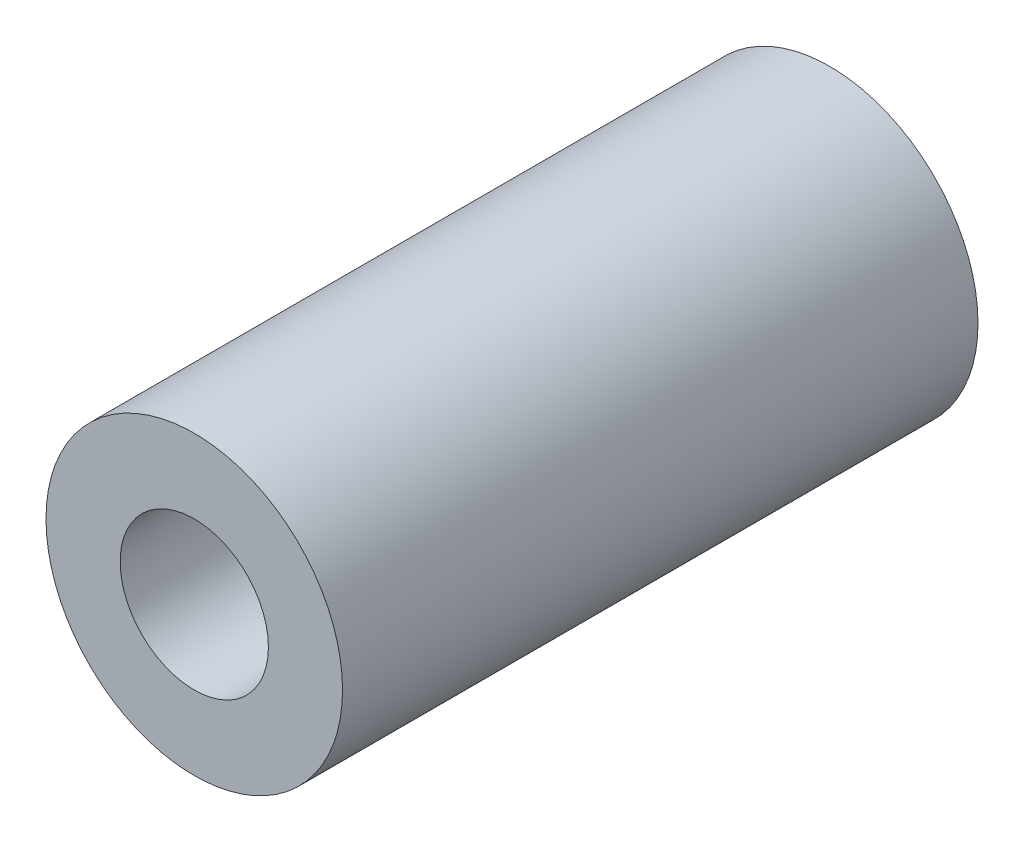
ISO-10303-21;
HEADER;
FILE_DESCRIPTION(('STEP AP214'),'2;1');
FILE_NAME('part.step','',(''),(''),'','','');
FILE_SCHEMA(('AUTOMOTIVE_DESIGN { 1 0 10303 214 1 1 1 1 }'));
ENDSEC;
DATA;
#1=APPLICATION_CONTEXT('core data for automotive mechanical design processes');
#2=APPLICATION_PROTOCOL_DEFINITION('international standard','automotive_design',2000,#1);
#3=PRODUCT_CONTEXT('',#1,'mechanical');
#4=PRODUCT('Part','Part','',(#3));
#5=PRODUCT_RELATED_PRODUCT_CATEGORY('part','',(#4));
#6=PRODUCT_DEFINITION_FORMATION('','',#4);
#7=PRODUCT_DEFINITION_CONTEXT('part definition',#1,'design');
#8=PRODUCT_DEFINITION('design','',#6,#7);
#9=PRODUCT_DEFINITION_SHAPE('','',#8);
#10=(LENGTH_UNIT() NAMED_UNIT(*) SI_UNIT(.MILLI.,.METRE.));
#11=(NAMED_UNIT(*) PLANE_ANGLE_UNIT() SI_UNIT($,.RADIAN.));
#12=(NAMED_UNIT(*) SI_UNIT($,.STERADIAN.) SOLID_ANGLE_UNIT());
#13=UNCERTAINTY_MEASURE_WITH_UNIT(LENGTH_MEASURE(1.E-05),#10,'distance_accuracy_value','');
#14=(GEOMETRIC_REPRESENTATION_CONTEXT(3) GLOBAL_UNCERTAINTY_ASSIGNED_CONTEXT((#13)) GLOBAL_UNIT_ASSIGNED_CONTEXT((#10,
#11,#12)) REPRESENTATION_CONTEXT('',''));
#15=CARTESIAN_POINT('',(0.,0.,0.));
#16=DIRECTION('',(0.,0.,1.));
#17=DIRECTION('',(1.,0.,0.));
#18=AXIS2_PLACEMENT_3D('',#15,#16,#17);
#19=CARTESIAN_POINT('',(0.,0.,-15.));
#20=DIRECTION('',(0.,0.,1.));
#21=DIRECTION('',(1.,0.,0.));
#22=AXIS2_PLACEMENT_3D('',#19,#20,#21);
#23=CYLINDRICAL_SURFACE('',#22,3.5);
#24=CARTESIAN_POINT('',(0.,0.,-15.));
#25=DIRECTION('',(0.,0.,1.));
#26=DIRECTION('',(1.,0.,0.));
#27=AXIS2_PLACEMENT_3D('',#24,#25,#26);
#28=CIRCLE('',#27,3.5);
#29=CARTESIAN_POINT('',(3.5,0.,-15.));
#30=VERTEX_POINT('',#29);
#31=EDGE_CURVE('E10',#30,#30,#28,.T.);
#32=ORIENTED_EDGE('',*,*,#31,.T.);
#33=EDGE_LOOP('',(#32));
#34=FACE_BOUND('',#33,.T.);
#35=CARTESIAN_POINT('',(0.,0.,0.));
#36=DIRECTION('',(0.,0.,1.));
#37=DIRECTION('',(1.,0.,0.));
#38=AXIS2_PLACEMENT_3D('',#35,#36,#37);
#39=CIRCLE('',#38,3.5);
#40=CARTESIAN_POINT('',(3.5,0.,0.));
#41=VERTEX_POINT('',#40);
#42=EDGE_CURVE('E30',#41,#41,#39,.T.);
#43=ORIENTED_EDGE('',*,*,#42,.F.);
#44=EDGE_LOOP('',(#43));
#45=FACE_BOUND('',#44,.T.);
#46=ADVANCED_FACE('F24',(#34,#45),#23,.T.);
#47=CARTESIAN_POINT('',(0.,0.,-15.));
#48=DIRECTION('',(0.,0.,1.));
#49=DIRECTION('',(1.,0.,0.));
#50=AXIS2_PLACEMENT_3D('',#47,#48,#49);
#51=PLANE('',#50);
#52=CARTESIAN_POINT('',(0.,0.,-15.));
#53=DIRECTION('',(0.,0.,1.));
#54=DIRECTION('',(1.,0.,0.));
#55=AXIS2_PLACEMENT_3D('',#52,#53,#54);
#56=CIRCLE('',#55,1.75);
#57=CARTESIAN_POINT('',(1.75,0.,-15.));
#58=VERTEX_POINT('',#57);
#59=EDGE_CURVE('E34',#58,#58,#56,.T.);
#60=ORIENTED_EDGE('',*,*,#59,.T.);
#61=EDGE_LOOP('',(#60));
#62=FACE_BOUND('',#61,.T.);
#63=ORIENTED_EDGE('',*,*,#31,.F.);
#64=EDGE_LOOP('',(#63));
#65=FACE_BOUND('',#64,.T.);
#66=ADVANCED_FACE('F48',(#62,#65),#51,.F.);
#67=CARTESIAN_POINT('',(0.,0.,0.));
#68=DIRECTION('',(0.,0.,1.));
#69=DIRECTION('',(1.,0.,0.));
#70=AXIS2_PLACEMENT_3D('',#67,#68,#69);
#71=PLANE('',#70);
#72=CARTESIAN_POINT('',(0.,0.,0.));
#73=DIRECTION('',(0.,0.,1.));
#74=DIRECTION('',(1.,0.,0.));
#75=AXIS2_PLACEMENT_3D('',#72,#73,#74);
#76=CIRCLE('',#75,1.75);
#77=CARTESIAN_POINT('',(1.75,0.,0.));
#78=VERTEX_POINT('',#77);
#79=EDGE_CURVE('E38',#78,#78,#76,.T.);
#80=ORIENTED_EDGE('',*,*,#79,.F.);
#81=EDGE_LOOP('',(#80));
#82=FACE_BOUND('',#81,.T.);
#83=ORIENTED_EDGE('',*,*,#42,.T.);
#84=EDGE_LOOP('',(#83));
#85=FACE_BOUND('',#84,.T.);
#86=ADVANCED_FACE('F46',(#82,#85),#71,.T.);
#87=CARTESIAN_POINT('',(0.,0.,-15.));
#88=DIRECTION('',(0.,0.,1.));
#89=DIRECTION('',(1.,0.,0.));
#90=AXIS2_PLACEMENT_3D('',#87,#88,#89);
#91=CYLINDRICAL_SURFACE('',#90,1.75);
#92=ORIENTED_EDGE('',*,*,#59,.F.);
#93=EDGE_LOOP('',(#92));
#94=FACE_BOUND('',#93,.T.);
#95=ORIENTED_EDGE('',*,*,#79,.T.);
#96=EDGE_LOOP('',(#95));
#97=FACE_BOUND('',#96,.T.);
#98=ADVANCED_FACE('F44',(#94,#97),#91,.F.);
#99=CLOSED_SHELL('',(#46,#66,#86,#98));
#100=MANIFOLD_SOLID_BREP('B2',#99);
#101=ADVANCED_BREP_SHAPE_REPRESENTATION('',(#18,#100),#14);
#102=SHAPE_DEFINITION_REPRESENTATION(#9,#101);
ENDSEC;
END-ISO-10303-21;
